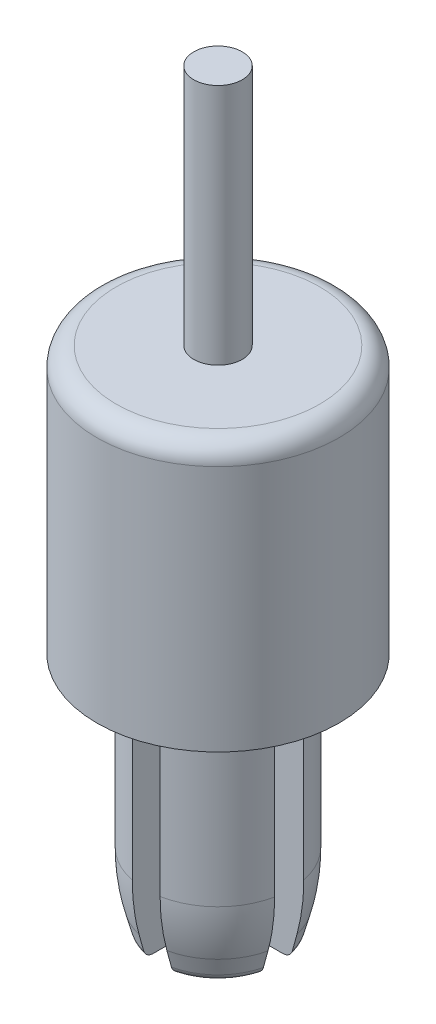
from build123d import *
from OCP.BRepFilletAPI import BRepFilletAPI_MakeChamfer

# Parameters (mm, degrees)
FILLET1_R      = 2
EXTRUDE1_START = 45
EXTRUDE1_DEPTH = 45
CHAMFER1_SIZE  = 5
CHAMFER1_SIZE2 = 1.339745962
FILLET2_R      = 20
FILLET3_R      = 1


with BuildPart() as part:
    # Sketch1 → Revolve1 (revolve)
    with BuildSketch(Plane.XY, mode=Mode.PRIVATE) as revolve1_sk:
        Polygon((0, 20), (7.5, 20), (7.5, 0), (12.5, 0), (12.5, 27.5), (2.5, 27.5), (2.5, 52.5), (0, 52.5), align=None)
    revolve(revolve1_sk.sketch.rotate(Axis((0, 20, 0), (0, -1, 0)), 180), axis=Axis((0, 20, 0), (0, -1, 0)))

    # Fillet1
    fillet1_edges = [part.edges().sort_by_distance(p)[0] for p in [
        (12.5, 27.5, 0),
    ]]
    fillet(fillet1_edges, radius=FILLET1_R)

    # Sketch2 → Extrude1 (add)
    with BuildSketch(Plane.XZ.offset(-20).offset(EXTRUDE1_START)):
        with BuildLine():
            Line((1.4, 7.368174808), (1.4, 1.5))
            Line((1.4, 1.5), (7.348469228, 1.5))
            ThreePointArc((7.348469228, 1.5), (5.267143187, 5.339213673), (1.4, 7.368174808))
        make_face()
        with BuildLine():
            Line((1.4, -1.5), (1.4, -7.368174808))
            ThreePointArc((1.4, -7.368174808), (5.267143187, -5.339213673), (7.348469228, -1.5))
            Line((7.348469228, -1.5), (1.4, -1.5))
        make_face()
        with BuildLine():
            ThreePointArc((-7.348469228, -1.5), (-5.303300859, -5.303300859), (-1.5, -7.348469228))
            Line((-1.5, -7.348469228), (-1.5, -1.5))
            Line((-1.5, -1.5), (-7.348469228, -1.5))
        make_face()
        with BuildLine():
            Line((-7.348469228, 1.5), (-1.5, 1.5))
            Line((-1.5, 1.5), (-1.5, 7.348469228))
            ThreePointArc((-1.5, 7.348469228), (-5.303300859, 5.303300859), (-7.348469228, 1.5))
        make_face()
    extrude(amount=-EXTRUDE1_DEPTH)

    # Chamfer1: one chamfer whose edges measure the first distance from different faces: ONE call of the kernel's chamfer builder (chamfer() names one face for all edges)
    chamfer1_edges_1 = [part.edges().sort_by_distance(p)[0] for p in [
        (5.267143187, -25, 5.339213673),
    ]]
    chamfer1_side_1 = [part.faces().sort_by_distance(p)[0] for p in [
        (5.267143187, -12.5, 5.339213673),
    ]]
    chamfer1_edges_2 = [part.edges().sort_by_distance(p)[0] for p in [
        (5.267143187, -25, -5.339213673),
    ]]
    chamfer1_side_2 = [part.faces().sort_by_distance(p)[0] for p in [
        (5.267143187, -12.5, -5.339213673),
    ]]
    chamfer1_edges_3 = [part.edges().sort_by_distance(p)[0] for p in [
        (-5.303300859, -25, -5.303300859),
    ]]
    chamfer1_side_3 = [part.faces().sort_by_distance(p)[0] for p in [
        (-5.303300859, -12.5, -5.303300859),
    ]]
    chamfer1_edges_4 = [part.edges().sort_by_distance(p)[0] for p in [
        (-5.303300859, -25, 5.303300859),
    ]]
    chamfer1_side_4 = [part.faces().sort_by_distance(p)[0] for p in [
        (-5.303300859, -12.5, 5.303300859),
    ]]
    chamfer1 = BRepFilletAPI_MakeChamfer(part.part.solid().wrapped)
    for e in chamfer1_edges_1:
        chamfer1.Add(CHAMFER1_SIZE, CHAMFER1_SIZE2, e.wrapped, chamfer1_side_1[0].wrapped)  # the first distance lies on this face
    for e in chamfer1_edges_2:
        chamfer1.Add(CHAMFER1_SIZE, CHAMFER1_SIZE2, e.wrapped, chamfer1_side_2[0].wrapped)  # the first distance lies on this face
    for e in chamfer1_edges_3:
        chamfer1.Add(CHAMFER1_SIZE, CHAMFER1_SIZE2, e.wrapped, chamfer1_side_3[0].wrapped)  # the first distance lies on this face
    for e in chamfer1_edges_4:
        chamfer1.Add(CHAMFER1_SIZE, CHAMFER1_SIZE2, e.wrapped, chamfer1_side_4[0].wrapped)  # the first distance lies on this face
    add(Compound.cast(chamfer1.Shape()), mode=Mode.REPLACE)

    # Fillet2
    fillet2_edges = [part.edges().sort_by_distance(p)[0] for p in [
        (-5.303300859, -20, 5.303300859),
        (5.267143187, -20, 5.339213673),
        (-5.303300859, -20, -5.303300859),
        (5.267143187, -20, -5.339213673),
    ]]
    fillet(fillet2_edges, radius=FILLET2_R)

    # Fillet3
    fillet3_edges = [part.edges().sort_by_distance(p)[0] for p in [
        (4.31942801, -25, -4.392182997),
        (-4.355957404, -25, -4.355957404),
        (-4.355957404, -25, 4.355957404),
        (4.31942801, -25, 4.392182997),
    ]]
    fillet(fillet3_edges, radius=FILLET3_R)


solid = part.part
